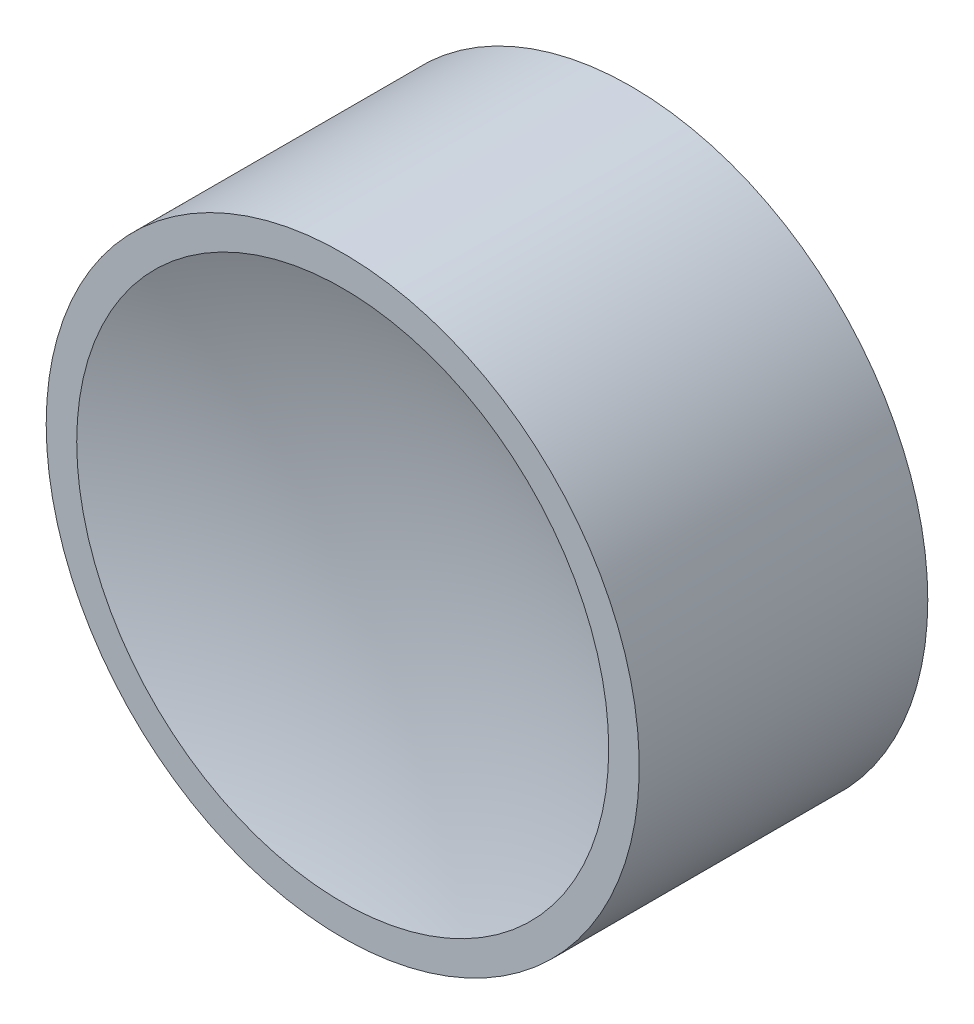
from build123d import *

# Parameters (mm, degrees)
SKETCH1_R           = 17
BOSS_EXTRUDE1_DEPTH = 17.217
SKETCH6_W           = 1.75
SKETCH6_H           = 0.672850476


with BuildPart() as part:
    # Sketch1 → Boss-Extrude1 (new body)
    with BuildSketch(Plane.XY):
        Circle(SKETCH1_R)
    extrude(amount=BOSS_EXTRUDE1_DEPTH)

    # Sketch5 → Revolve2 (revolve)
    with BuildSketch(Plane(origin=(0, 0, 0), x_dir=(1, 0, 0), z_dir=(0, 1, 0))):
        with BuildLine():
            Line((17, 0), (0, 0))
            Line((0, 0), (0, 2.309402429))
            ThreePointArc((0, 2.309402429), (8.578072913, 1.729412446), (17, 0))
        make_face()
    revolve(axis=Axis((0, 0, 0), (0, 0, -1)))

    # Sketch4 → Cut-Revolve1 (revolve, cut)
    with BuildSketch(Plane(origin=(0, 0, 0), x_dir=(1, 0, 0), z_dir=(0, 1, 0))):
        with BuildLine():
            Line((17, -17.217), (0, -17.217))
            Line((0, -17.217), (0, -13.877684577))
            ThreePointArc((0, -13.877684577), (8.662433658, -14.720414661), (17, -17.217))
        make_face()
    revolve(axis=Axis((0, 0, 17.217), (0, 0, -1)), mode=Mode.SUBTRACT)

    # Sketch6 → Cut-Revolve2 (revolve, cut)
    with BuildSketch(Plane(origin=(0, 0, 0), x_dir=(1, 0, 0), z_dir=(0, 1, 0))):
        with Locations((-16.125, -16.880574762)):
            Rectangle(SKETCH6_W, SKETCH6_H)
    revolve(axis=Axis((0, 0, 0), (0, 0, 1)), mode=Mode.SUBTRACT)


solid = part.part
